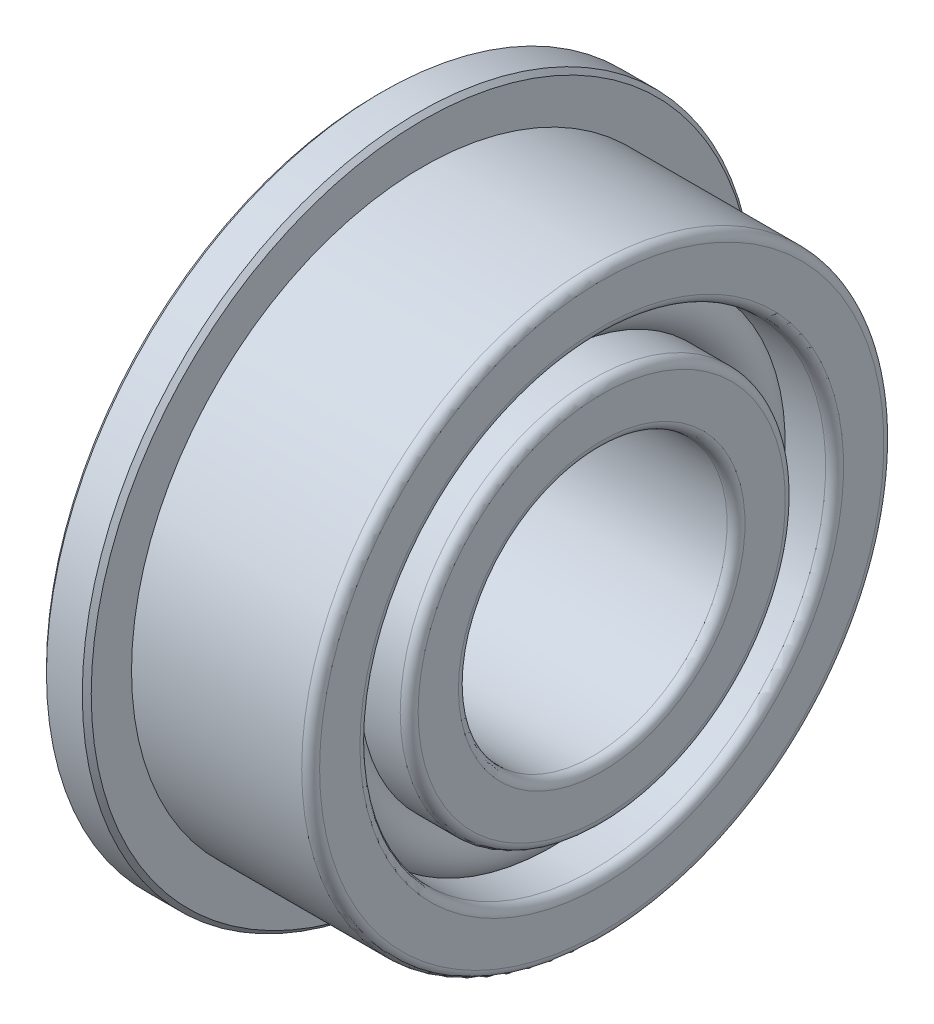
from build123d import *

# Parameters (mm, degrees)
EXTRUDE_START   = 1
SKETCH_2_R      = 7.5
SKETCH_2_R_2    = 3
EXTRUDE_1_DEPTH = 1
CHAMFER_1_SIZE  = 0.1


with BuildPart() as part:
    # Sketch 1 → Revolve 1 (revolve)
    with BuildSketch(Plane.XY, mode=Mode.PRIVATE) as revolve_1_sk:
        with BuildLine():
            Line((0, 6.5), (3.8, 6.5))
            ThreePointArc((3.8, 6.5), (3.941421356, 6.441421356), (4, 6.3))
            Line((4, 6.3), (4, 5.4))
            ThreePointArc((4, 5.4), (3.941421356, 5.258578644), (3.8, 5.2))
            Line((3.8, 5.2), (2.896862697, 5.2))
            ThreePointArc((2.896862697, 5.2), (3.1, 4.75), (2.896862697, 4.3))
            Line((2.896862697, 4.3), (3.8, 4.3))
            ThreePointArc((3.8, 4.3), (3.941421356, 4.241421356), (4, 4.1))
            Line((4, 4.1), (4, 3.2))
            ThreePointArc((4, 3.2), (3.941421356, 3.058578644), (3.8, 3))
            Line((3.8, 3), (0, 3))
            Line((0, 3), (0, 4.108384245))
            ThreePointArc((0, 4.108384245), (0.056122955, 4.243877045), (0.191615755, 4.3))
            Line((0.191615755, 4.3), (2.103137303, 4.3))
            ThreePointArc((2.103137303, 4.3), (1.9, 4.75), (2.103137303, 5.2))
            Line((2.103137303, 5.2), (0.191615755, 5.2))
            ThreePointArc((0.191615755, 5.2), (0.056122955, 5.256122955), (0, 5.391615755))
            Line((0, 5.391615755), (0, 6.5))
        make_face()
    revolve(revolve_1_sk.sketch.rotate(Axis((0, 0, 0), (1, 0, 0)), 90), axis=Axis((0, 0, 0), (1, 0, 0)))

    # Sketch 2 → Extrude 1 (add)
    with BuildSketch(Plane.ZY.offset(EXTRUDE_START)):
        Circle(SKETCH_2_R)
        Circle(SKETCH_2_R_2, mode=Mode.SUBTRACT)
    extrude(amount=-EXTRUDE_1_DEPTH)

    # Chamfer 1
    chamfer_1_edges = [part.edges().sort_by_distance(p)[0] for p in [
        (-1, 0, -7.5),
        (0, 0, -7.5),
        (-1, 0, -3),
    ]]
    chamfer(chamfer_1_edges, length=CHAMFER_1_SIZE)


solid = part.part
